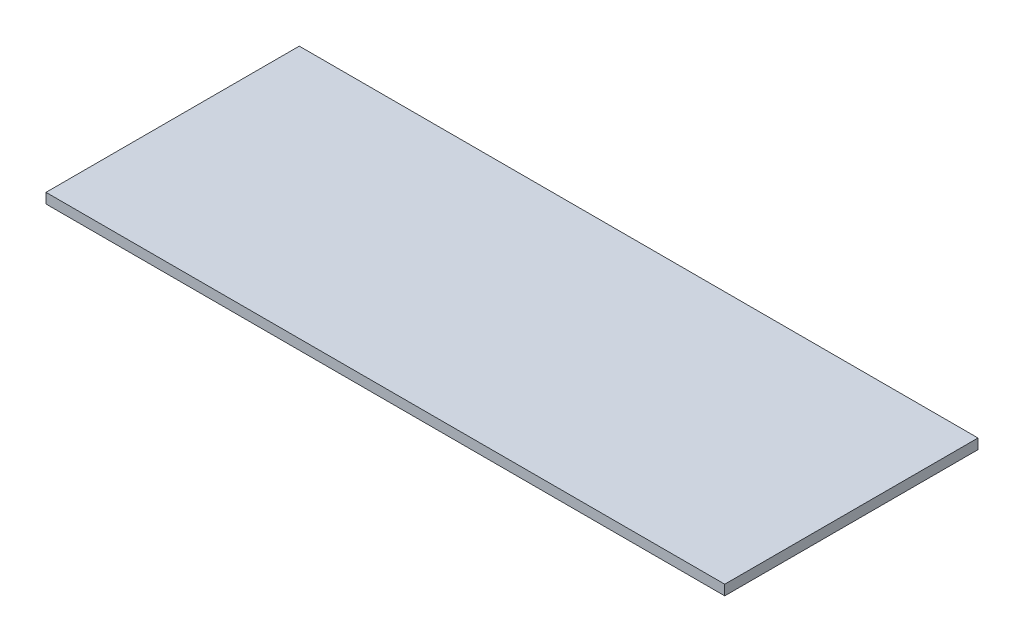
from build123d import *

# Parameters (mm, degrees)
SKETCH1_W           = 134
SKETCH1_H           = 50
BOSS_EXTRUDE1_DEPTH = 2


with BuildPart() as part:
    # Sketch1 → Boss-Extrude1 (new body)
    with BuildSketch(Plane(origin=(0, 0, 0), x_dir=(1, 0, 0), z_dir=(0, 1, 0))):
        Rectangle(SKETCH1_W, SKETCH1_H)
    extrude(amount=BOSS_EXTRUDE1_DEPTH)


solid = part.part
